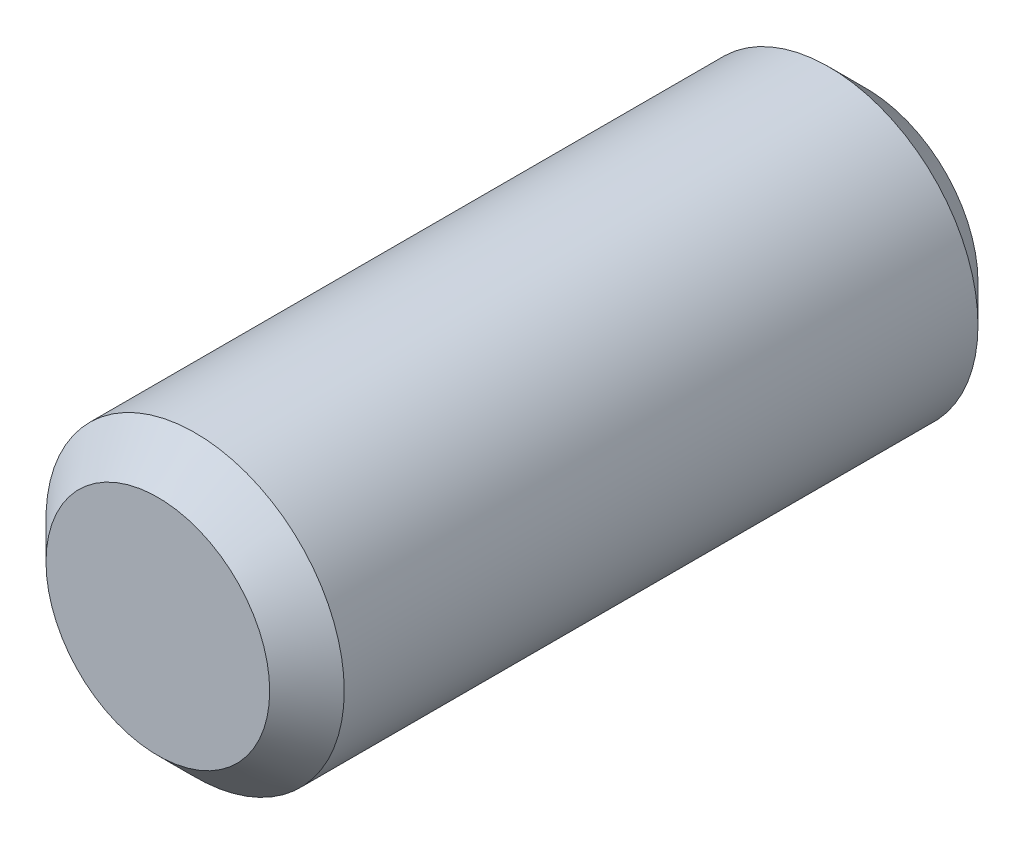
from build123d import *

# Parameters (mm, degrees)
ESQUISSE1_R         = 2
BASEEXTRUSION_DEPTH = 9.5
CHANFREIN1_SIZE     = 0.5


with BuildPart() as part:
    # Esquisse1 → BaseExtrusion (new body)
    with BuildSketch(Plane.XY):
        Circle(ESQUISSE1_R)
    extrude(amount=BASEEXTRUSION_DEPTH)

    # Chanfrein1
    chanfrein1_edges = [part.edges().sort_by_distance(p)[0] for p in [
        (-2, 0, 0),
        (-2, 0, 9.5),
    ]]
    chamfer(chanfrein1_edges, length=CHANFREIN1_SIZE)


solid = part.part
